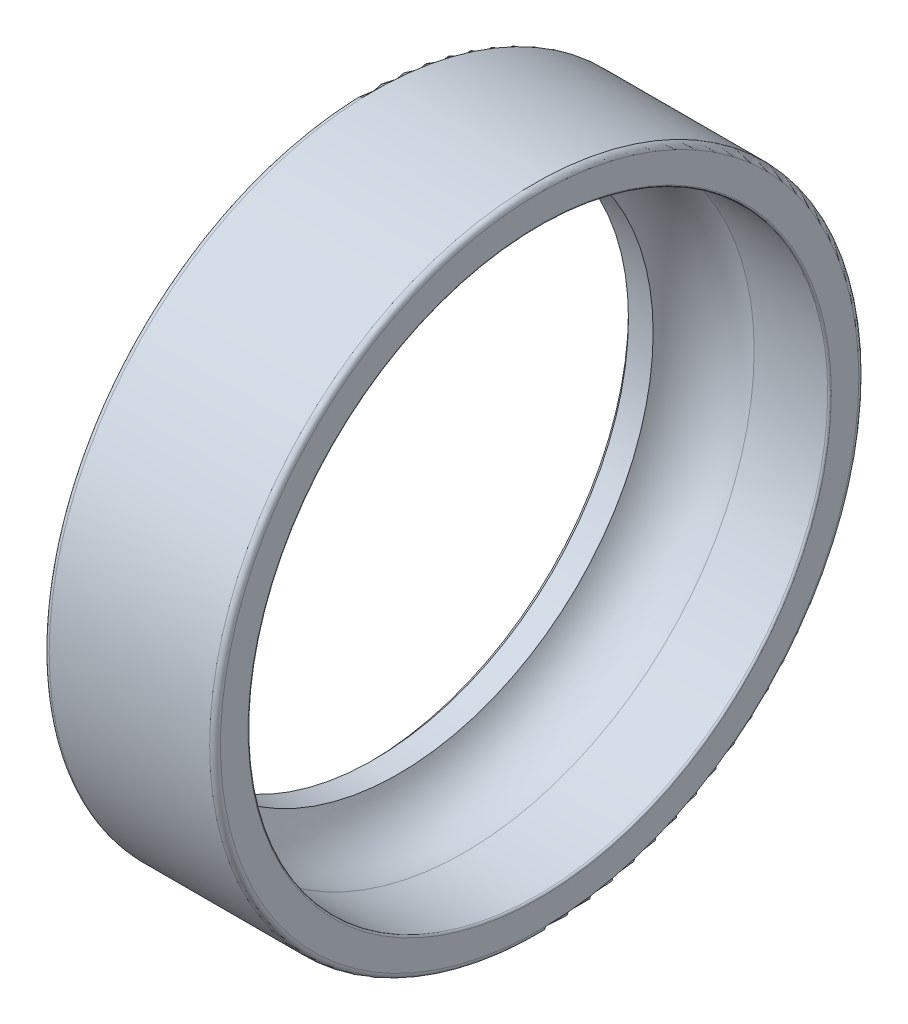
ISO-10303-21;
HEADER;
FILE_DESCRIPTION(('STEP AP214'),'2;1');
FILE_NAME('part.step','',(''),(''),'','','');
FILE_SCHEMA(('AUTOMOTIVE_DESIGN { 1 0 10303 214 1 1 1 1 }'));
ENDSEC;
DATA;
#1=APPLICATION_CONTEXT('core data for automotive mechanical design processes');
#2=APPLICATION_PROTOCOL_DEFINITION('international standard','automotive_design',2000,#1);
#3=PRODUCT_CONTEXT('',#1,'mechanical');
#4=PRODUCT('Part','Part','',(#3));
#5=PRODUCT_RELATED_PRODUCT_CATEGORY('part','',(#4));
#6=PRODUCT_DEFINITION_FORMATION('','',#4);
#7=PRODUCT_DEFINITION_CONTEXT('part definition',#1,'design');
#8=PRODUCT_DEFINITION('design','',#6,#7);
#9=PRODUCT_DEFINITION_SHAPE('','',#8);
#10=(LENGTH_UNIT() NAMED_UNIT(*) SI_UNIT(.MILLI.,.METRE.));
#11=(NAMED_UNIT(*) PLANE_ANGLE_UNIT() SI_UNIT($,.RADIAN.));
#12=(NAMED_UNIT(*) SI_UNIT($,.STERADIAN.) SOLID_ANGLE_UNIT());
#13=UNCERTAINTY_MEASURE_WITH_UNIT(LENGTH_MEASURE(1.E-05),#10,'distance_accuracy_value','');
#14=(GEOMETRIC_REPRESENTATION_CONTEXT(3) GLOBAL_UNCERTAINTY_ASSIGNED_CONTEXT((#13)) GLOBAL_UNIT_ASSIGNED_CONTEXT((#10,
#11,#12)) REPRESENTATION_CONTEXT('',''));
#15=CARTESIAN_POINT('',(0.,0.,0.));
#16=DIRECTION('',(0.,0.,1.));
#17=DIRECTION('',(1.,0.,0.));
#18=AXIS2_PLACEMENT_3D('',#15,#16,#17);
#19=CARTESIAN_POINT('',(0.599999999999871,0.,0.));
#20=DIRECTION('',(1.,0.,0.));
#21=DIRECTION('',(0.,0.,-1.));
#22=AXIS2_PLACEMENT_3D('',#19,#20,#21);
#23=TOROIDAL_SURFACE('',#22,35.4000000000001,0.599999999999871);
#24=CARTESIAN_POINT('',(0.,0.,0.));
#25=DIRECTION('',(1.,0.,0.));
#26=DIRECTION('',(0.,0.,-1.));
#27=AXIS2_PLACEMENT_3D('',#24,#25,#26);
#28=CIRCLE('',#27,35.4);
#29=CARTESIAN_POINT('',(0.,0.,-35.4));
#30=VERTEX_POINT('',#29);
#31=EDGE_CURVE('E10',#30,#30,#28,.T.);
#32=ORIENTED_EDGE('',*,*,#31,.T.);
#33=EDGE_LOOP('',(#32));
#34=FACE_BOUND('',#33,.T.);
#35=CARTESIAN_POINT('',(0.6,0.,0.));
#36=DIRECTION('',(1.,0.,0.));
#37=DIRECTION('',(0.,0.,-1.));
#38=AXIS2_PLACEMENT_3D('',#35,#36,#37);
#39=CIRCLE('',#38,36.);
#40=CARTESIAN_POINT('',(0.6,0.,-36.));
#41=VERTEX_POINT('',#40);
#42=EDGE_CURVE('E62',#41,#41,#39,.T.);
#43=ORIENTED_EDGE('',*,*,#42,.F.);
#44=EDGE_LOOP('',(#43));
#45=FACE_BOUND('',#44,.T.);
#46=ADVANCED_FACE('F28',(#34,#45),#23,.T.);
#47=CARTESIAN_POINT('',(0.,35.4,0.));
#48=DIRECTION('',(-1.,0.,0.));
#49=DIRECTION('',(0.,0.,1.));
#50=AXIS2_PLACEMENT_3D('',#47,#48,#49);
#51=PLANE('',#50);
#52=CARTESIAN_POINT('',(0.,0.,0.));
#53=DIRECTION('',(1.,0.,0.));
#54=DIRECTION('',(0.,0.,-1.));
#55=AXIS2_PLACEMENT_3D('',#52,#53,#54);
#56=CIRCLE('',#55,28.85);
#57=CARTESIAN_POINT('',(0.,0.,-28.85));
#58=VERTEX_POINT('',#57);
#59=EDGE_CURVE('E34',#58,#58,#56,.T.);
#60=ORIENTED_EDGE('',*,*,#59,.T.);
#61=EDGE_LOOP('',(#60));
#62=FACE_BOUND('',#61,.T.);
#63=ORIENTED_EDGE('',*,*,#31,.F.);
#64=EDGE_LOOP('',(#63));
#65=FACE_BOUND('',#64,.T.);
#66=ADVANCED_FACE('F70',(#62,#65),#51,.T.);
#67=CARTESIAN_POINT('',(0.,0.,0.));
#68=DIRECTION('',(-1.,0.,0.));
#69=DIRECTION('',(0.,0.,1.));
#70=AXIS2_PLACEMENT_3D('',#67,#68,#69);
#71=CONICAL_SURFACE('',#70,28.85,0.785398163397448);
#72=CARTESIAN_POINT('',(0.6,0.,0.));
#73=DIRECTION('',(1.,0.,0.));
#74=DIRECTION('',(0.,0.,-1.));
#75=AXIS2_PLACEMENT_3D('',#72,#73,#74);
#76=CIRCLE('',#75,28.25);
#77=CARTESIAN_POINT('',(0.6,0.,-28.25));
#78=VERTEX_POINT('',#77);
#79=EDGE_CURVE('E38',#78,#78,#76,.T.);
#80=ORIENTED_EDGE('',*,*,#79,.T.);
#81=EDGE_LOOP('',(#80));
#82=FACE_BOUND('',#81,.T.);
#83=ORIENTED_EDGE('',*,*,#59,.F.);
#84=EDGE_LOOP('',(#83));
#85=FACE_BOUND('',#84,.T.);
#86=ADVANCED_FACE('F74',(#82,#85),#71,.F.);
#87=CARTESIAN_POINT('',(19.,0.,0.));
#88=DIRECTION('',(1.,0.,0.));
#89=DIRECTION('',(0.,0.,-1.));
#90=AXIS2_PLACEMENT_3D('',#87,#88,#89);
#91=CYLINDRICAL_SURFACE('',#90,28.25);
#92=CARTESIAN_POINT('',(3.3388711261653,0.,0.));
#93=DIRECTION('',(1.,0.,0.));
#94=DIRECTION('',(0.,0.,-1.));
#95=AXIS2_PLACEMENT_3D('',#92,#93,#94);
#96=CIRCLE('',#95,28.25);
#97=CARTESIAN_POINT('',(3.3388711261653,0.,-28.25));
#98=VERTEX_POINT('',#97);
#99=EDGE_CURVE('E42',#98,#98,#96,.T.);
#100=ORIENTED_EDGE('',*,*,#99,.T.);
#101=EDGE_LOOP('',(#100));
#102=FACE_BOUND('',#101,.T.);
#103=ORIENTED_EDGE('',*,*,#79,.F.);
#104=EDGE_LOOP('',(#103));
#105=FACE_BOUND('',#104,.T.);
#106=ADVANCED_FACE('F78',(#102,#105),#91,.F.);
#107=CARTESIAN_POINT('',(9.50000000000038,0.,0.));
#108=DIRECTION('',(1.,0.,0.));
#109=DIRECTION('',(0.,0.,-1.));
#110=AXIS2_PLACEMENT_3D('',#107,#108,#109);
#111=TOROIDAL_SURFACE('',#110,25.4999999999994,6.74700000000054);
#112=CARTESIAN_POINT('',(10.639960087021,0.,0.));
#113=DIRECTION('',(1.,0.,0.));
#114=DIRECTION('',(0.,0.,-1.));
#115=AXIS2_PLACEMENT_3D('',#112,#113,#114);
#116=CIRCLE('',#115,32.15);
#117=CARTESIAN_POINT('',(10.639960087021,0.,-32.15));
#118=VERTEX_POINT('',#117);
#119=EDGE_CURVE('E47',#118,#118,#116,.T.);
#120=ORIENTED_EDGE('',*,*,#119,.T.);
#121=EDGE_LOOP('',(#120));
#122=FACE_BOUND('',#121,.T.);
#123=ORIENTED_EDGE('',*,*,#99,.F.);
#124=EDGE_LOOP('',(#123));
#125=FACE_BOUND('',#124,.T.);
#126=ADVANCED_FACE('F85',(#122,#125),#111,.F.);
#127=CARTESIAN_POINT('',(19.,0.,0.));
#128=DIRECTION('',(1.,0.,0.));
#129=DIRECTION('',(0.,0.,-1.));
#130=AXIS2_PLACEMENT_3D('',#127,#128,#129);
#131=CYLINDRICAL_SURFACE('',#130,32.15);
#132=CARTESIAN_POINT('',(18.8,0.,0.));
#133=DIRECTION('',(1.,0.,0.));
#134=DIRECTION('',(0.,0.,-1.));
#135=AXIS2_PLACEMENT_3D('',#132,#133,#134);
#136=CIRCLE('',#135,32.15);
#137=CARTESIAN_POINT('',(18.8,0.,-32.15));
#138=VERTEX_POINT('',#137);
#139=EDGE_CURVE('E50',#138,#138,#136,.T.);
#140=ORIENTED_EDGE('',*,*,#139,.T.);
#141=EDGE_LOOP('',(#140));
#142=FACE_BOUND('',#141,.T.);
#143=ORIENTED_EDGE('',*,*,#119,.F.);
#144=EDGE_LOOP('',(#143));
#145=FACE_BOUND('',#144,.T.);
#146=ADVANCED_FACE('F89',(#142,#145),#131,.F.);
#147=CARTESIAN_POINT('',(18.7999999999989,0.,0.));
#148=DIRECTION('',(1.,0.,0.));
#149=DIRECTION('',(0.,0.,-1.));
#150=AXIS2_PLACEMENT_3D('',#147,#148,#149);
#151=TOROIDAL_SURFACE('',#150,32.3500000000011,0.200000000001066);
#152=CARTESIAN_POINT('',(19.,0.,0.));
#153=DIRECTION('',(1.,0.,0.));
#154=DIRECTION('',(0.,0.,-1.));
#155=AXIS2_PLACEMENT_3D('',#152,#153,#154);
#156=CIRCLE('',#155,32.35);
#157=CARTESIAN_POINT('',(19.,0.,-32.35));
#158=VERTEX_POINT('',#157);
#159=EDGE_CURVE('E53',#158,#158,#156,.T.);
#160=ORIENTED_EDGE('',*,*,#159,.T.);
#161=EDGE_LOOP('',(#160));
#162=FACE_BOUND('',#161,.T.);
#163=ORIENTED_EDGE('',*,*,#139,.F.);
#164=EDGE_LOOP('',(#163));
#165=FACE_BOUND('',#164,.T.);
#166=ADVANCED_FACE('F93',(#162,#165),#151,.T.);
#167=CARTESIAN_POINT('',(19.,32.35,0.));
#168=DIRECTION('',(1.,0.,0.));
#169=DIRECTION('',(0.,0.,-1.));
#170=AXIS2_PLACEMENT_3D('',#167,#168,#169);
#171=PLANE('',#170);
#172=CARTESIAN_POINT('',(19.,0.,0.));
#173=DIRECTION('',(1.,0.,0.));
#174=DIRECTION('',(0.,0.,-1.));
#175=AXIS2_PLACEMENT_3D('',#172,#173,#174);
#176=CIRCLE('',#175,35.4);
#177=CARTESIAN_POINT('',(19.,0.,-35.4));
#178=VERTEX_POINT('',#177);
#179=EDGE_CURVE('E56',#178,#178,#176,.T.);
#180=ORIENTED_EDGE('',*,*,#179,.T.);
#181=EDGE_LOOP('',(#180));
#182=FACE_BOUND('',#181,.T.);
#183=ORIENTED_EDGE('',*,*,#159,.F.);
#184=EDGE_LOOP('',(#183));
#185=FACE_BOUND('',#184,.T.);
#186=ADVANCED_FACE('F97',(#182,#185),#171,.T.);
#187=CARTESIAN_POINT('',(18.4000000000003,0.,0.));
#188=DIRECTION('',(1.,0.,0.));
#189=DIRECTION('',(0.,0.,-1.));
#190=AXIS2_PLACEMENT_3D('',#187,#188,#189);
#191=TOROIDAL_SURFACE('',#190,35.4000000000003,0.599999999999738);
#192=CARTESIAN_POINT('',(18.4,0.,0.));
#193=DIRECTION('',(1.,0.,0.));
#194=DIRECTION('',(0.,0.,-1.));
#195=AXIS2_PLACEMENT_3D('',#192,#193,#194);
#196=CIRCLE('',#195,36.);
#197=CARTESIAN_POINT('',(18.4,0.,-36.));
#198=VERTEX_POINT('',#197);
#199=EDGE_CURVE('E59',#198,#198,#196,.T.);
#200=ORIENTED_EDGE('',*,*,#199,.T.);
#201=EDGE_LOOP('',(#200));
#202=FACE_BOUND('',#201,.T.);
#203=ORIENTED_EDGE('',*,*,#179,.F.);
#204=EDGE_LOOP('',(#203));
#205=FACE_BOUND('',#204,.T.);
#206=ADVANCED_FACE('F101',(#202,#205),#191,.T.);
#207=CARTESIAN_POINT('',(19.,0.,0.));
#208=DIRECTION('',(1.,0.,0.));
#209=DIRECTION('',(0.,0.,-1.));
#210=AXIS2_PLACEMENT_3D('',#207,#208,#209);
#211=CYLINDRICAL_SURFACE('',#210,36.);
#212=ORIENTED_EDGE('',*,*,#42,.T.);
#213=EDGE_LOOP('',(#212));
#214=FACE_BOUND('',#213,.T.);
#215=ORIENTED_EDGE('',*,*,#199,.F.);
#216=EDGE_LOOP('',(#215));
#217=FACE_BOUND('',#216,.T.);
#218=ADVANCED_FACE('F66',(#214,#217),#211,.T.);
#219=CLOSED_SHELL('',(#46,#66,#86,#106,#126,#146,#166,#186,#206,#218));
#220=MANIFOLD_SOLID_BREP('B2',#219);
#221=ADVANCED_BREP_SHAPE_REPRESENTATION('',(#18,#220),#14);
#222=SHAPE_DEFINITION_REPRESENTATION(#9,#221);
ENDSEC;
END-ISO-10303-21;
